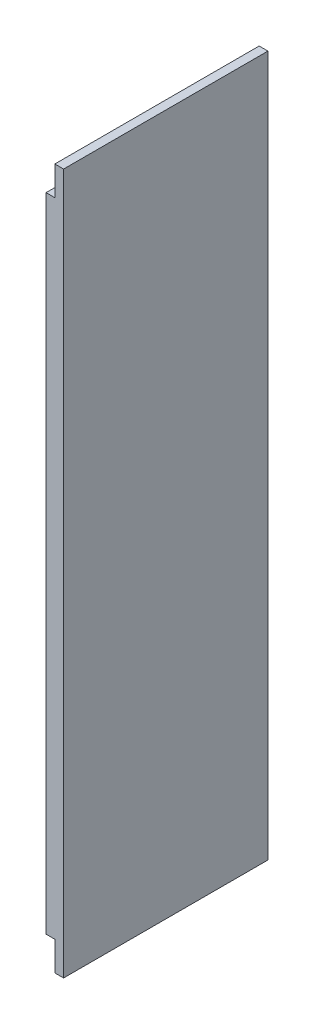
ISO-10303-21;
HEADER;
FILE_DESCRIPTION(('STEP AP214'),'2;1');
FILE_NAME('part.step','',(''),(''),'','','');
FILE_SCHEMA(('AUTOMOTIVE_DESIGN { 1 0 10303 214 1 1 1 1 }'));
ENDSEC;
DATA;
#1=APPLICATION_CONTEXT('core data for automotive mechanical design processes');
#2=APPLICATION_PROTOCOL_DEFINITION('international standard','automotive_design',2000,#1);
#3=PRODUCT_CONTEXT('',#1,'mechanical');
#4=PRODUCT('Part','Part','',(#3));
#5=PRODUCT_RELATED_PRODUCT_CATEGORY('part','',(#4));
#6=PRODUCT_DEFINITION_FORMATION('','',#4);
#7=PRODUCT_DEFINITION_CONTEXT('part definition',#1,'design');
#8=PRODUCT_DEFINITION('design','',#6,#7);
#9=PRODUCT_DEFINITION_SHAPE('','',#8);
#10=(LENGTH_UNIT() NAMED_UNIT(*) SI_UNIT(.MILLI.,.METRE.));
#11=(NAMED_UNIT(*) PLANE_ANGLE_UNIT() SI_UNIT($,.RADIAN.));
#12=(NAMED_UNIT(*) SI_UNIT($,.STERADIAN.) SOLID_ANGLE_UNIT());
#13=UNCERTAINTY_MEASURE_WITH_UNIT(LENGTH_MEASURE(1.E-05),#10,'distance_accuracy_value','');
#14=(GEOMETRIC_REPRESENTATION_CONTEXT(3) GLOBAL_UNCERTAINTY_ASSIGNED_CONTEXT((#13)) GLOBAL_UNIT_ASSIGNED_CONTEXT((#10,
#11,#12)) REPRESENTATION_CONTEXT('',''));
#15=CARTESIAN_POINT('',(0.,0.,0.));
#16=DIRECTION('',(0.,0.,1.));
#17=DIRECTION('',(1.,0.,0.));
#18=AXIS2_PLACEMENT_3D('',#15,#16,#17);
#19=CARTESIAN_POINT('',(-97.,0.,-310.018749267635));
#20=DIRECTION('',(-1.,0.,0.));
#21=DIRECTION('',(0.,0.,1.));
#22=AXIS2_PLACEMENT_3D('',#19,#20,#21);
#23=PLANE('',#22);
#24=DIRECTION('',(0.,1.,0.));
#25=VECTOR('',#24,1.);
#26=CARTESIAN_POINT('',(-97.,0.,-70.0000000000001));
#27=LINE('',#26,#25);
#28=CARTESIAN_POINT('',(-97.,-10.,-70.0000000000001));
#29=VERTEX_POINT('',#28);
#30=CARTESIAN_POINT('',(-97.,0.,-70.0000000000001));
#31=VERTEX_POINT('',#30);
#32=EDGE_CURVE('E58',#29,#31,#27,.T.);
#33=ORIENTED_EDGE('',*,*,#32,.F.);
#34=DIRECTION('',(0.,0.,1.));
#35=VECTOR('',#34,1.);
#36=CARTESIAN_POINT('',(-97.,-10.,-290.022325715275));
#37=LINE('',#36,#35);
#38=CARTESIAN_POINT('',(-97.,-10.,0.));
#39=VERTEX_POINT('',#38);
#40=EDGE_CURVE('E54',#29,#39,#37,.T.);
#41=ORIENTED_EDGE('',*,*,#40,.T.);
#42=DIRECTION('',(0.,-1.,0.));
#43=VECTOR('',#42,1.);
#44=CARTESIAN_POINT('',(-97.,0.,0.));
#45=LINE('',#44,#43);
#46=CARTESIAN_POINT('',(-97.,0.,0.));
#47=VERTEX_POINT('',#46);
#48=EDGE_CURVE('E155',#47,#39,#45,.T.);
#49=ORIENTED_EDGE('',*,*,#48,.F.);
#50=DIRECTION('',(0.,0.,1.));
#51=VECTOR('',#50,1.);
#52=CARTESIAN_POINT('',(-97.,0.,-310.018749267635));
#53=LINE('',#52,#51);
#54=EDGE_CURVE('E154',#31,#47,#53,.T.);
#55=ORIENTED_EDGE('',*,*,#54,.F.);
#56=EDGE_LOOP('',(#33,#41,#49,#55));
#57=FACE_BOUND('',#56,.T.);
#58=ADVANCED_FACE('F39',(#57),#23,.T.);
#59=DIRECTION('',(0.,0.,1.));
#60=VECTOR('',#59,1.);
#61=CARTESIAN_POINT('',(-97.,-230.001872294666,-290.022325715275));
#62=LINE('',#61,#60);
#63=CARTESIAN_POINT('',(-97.,-230.001872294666,-70.0000000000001));
#64=VERTEX_POINT('',#63);
#65=CARTESIAN_POINT('',(-97.,-230.001872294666,0.));
#66=VERTEX_POINT('',#65);
#67=EDGE_CURVE('E118',#64,#66,#62,.T.);
#68=ORIENTED_EDGE('',*,*,#67,.F.);
#69=CARTESIAN_POINT('',(-97.,-240.,-70.0000000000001));
#70=VERTEX_POINT('',#69);
#71=EDGE_CURVE('E141',#70,#64,#27,.T.);
#72=ORIENTED_EDGE('',*,*,#71,.F.);
#73=DIRECTION('',(0.,0.,1.));
#74=VECTOR('',#73,1.);
#75=CARTESIAN_POINT('',(-97.,-240.,-310.018749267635));
#76=LINE('',#75,#74);
#77=CARTESIAN_POINT('',(-97.,-240.,0.));
#78=VERTEX_POINT('',#77);
#79=EDGE_CURVE('E137',#70,#78,#76,.T.);
#80=ORIENTED_EDGE('',*,*,#79,.T.);
#81=EDGE_CURVE('E152',#66,#78,#45,.T.);
#82=ORIENTED_EDGE('',*,*,#81,.F.);
#83=EDGE_LOOP('',(#68,#72,#80,#82));
#84=FACE_BOUND('',#83,.T.);
#85=ADVANCED_FACE('F181',(#84),#23,.T.);
#86=CARTESIAN_POINT('',(-97.,0.,-310.018749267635));
#87=DIRECTION('',(0.,1.,0.));
#88=DIRECTION('',(0.,0.,1.));
#89=AXIS2_PLACEMENT_3D('',#86,#87,#88);
#90=PLANE('',#89);
#91=DIRECTION('',(1.,0.,0.));
#92=VECTOR('',#91,1.);
#93=CARTESIAN_POINT('',(-97.,0.,-70.0000000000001));
#94=LINE('',#93,#92);
#95=CARTESIAN_POINT('',(-93.9999999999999,0.,-70.0000000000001));
#96=VERTEX_POINT('',#95);
#97=EDGE_CURVE('E139',#31,#96,#94,.T.);
#98=ORIENTED_EDGE('',*,*,#97,.F.);
#99=ORIENTED_EDGE('',*,*,#54,.T.);
#100=DIRECTION('',(-1.,0.,0.));
#101=VECTOR('',#100,1.);
#102=CARTESIAN_POINT('',(-97.,0.,0.));
#103=LINE('',#102,#101);
#104=CARTESIAN_POINT('',(-93.9999999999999,0.,0.));
#105=VERTEX_POINT('',#104);
#106=EDGE_CURVE('E142',#105,#47,#103,.T.);
#107=ORIENTED_EDGE('',*,*,#106,.F.);
#108=DIRECTION('',(0.,0.,1.));
#109=VECTOR('',#108,1.);
#110=CARTESIAN_POINT('',(-93.9999999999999,0.,-310.018749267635));
#111=LINE('',#110,#109);
#112=EDGE_CURVE('E160',#96,#105,#111,.T.);
#113=ORIENTED_EDGE('',*,*,#112,.F.);
#114=EDGE_LOOP('',(#98,#99,#107,#113));
#115=FACE_BOUND('',#114,.T.);
#116=ADVANCED_FACE('F170',(#115),#90,.T.);
#117=CARTESIAN_POINT('',(-93.9999999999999,0.,-310.018749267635));
#118=DIRECTION('',(1.,0.,0.));
#119=DIRECTION('',(0.,0.,-1.));
#120=AXIS2_PLACEMENT_3D('',#117,#118,#119);
#121=PLANE('',#120);
#122=DIRECTION('',(0.,-1.,0.));
#123=VECTOR('',#122,1.);
#124=CARTESIAN_POINT('',(-93.9999999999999,0.,-70.0000000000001));
#125=LINE('',#124,#123);
#126=CARTESIAN_POINT('',(-93.9999999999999,-240.,-70.0000000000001));
#127=VERTEX_POINT('',#126);
#128=EDGE_CURVE('E43',#96,#127,#125,.T.);
#129=ORIENTED_EDGE('',*,*,#128,.F.);
#130=ORIENTED_EDGE('',*,*,#112,.T.);
#131=DIRECTION('',(0.,1.,0.));
#132=VECTOR('',#131,1.);
#133=CARTESIAN_POINT('',(-93.9999999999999,0.,0.));
#134=LINE('',#133,#132);
#135=CARTESIAN_POINT('',(-93.9999999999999,-240.,0.));
#136=VERTEX_POINT('',#135);
#137=EDGE_CURVE('E147',#136,#105,#134,.T.);
#138=ORIENTED_EDGE('',*,*,#137,.F.);
#139=DIRECTION('',(0.,0.,1.));
#140=VECTOR('',#139,1.);
#141=CARTESIAN_POINT('',(-93.9999999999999,-240.,-310.018749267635));
#142=LINE('',#141,#140);
#143=EDGE_CURVE('E159',#127,#136,#142,.T.);
#144=ORIENTED_EDGE('',*,*,#143,.F.);
#145=EDGE_LOOP('',(#129,#130,#138,#144));
#146=FACE_BOUND('',#145,.T.);
#147=ADVANCED_FACE('F172',(#146),#121,.T.);
#148=CARTESIAN_POINT('',(-97.,-240.,-310.018749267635));
#149=DIRECTION('',(0.,-1.,0.));
#150=DIRECTION('',(0.,0.,-1.));
#151=AXIS2_PLACEMENT_3D('',#148,#149,#150);
#152=PLANE('',#151);
#153=DIRECTION('',(-1.,0.,0.));
#154=VECTOR('',#153,1.);
#155=CARTESIAN_POINT('',(-97.,-240.,-70.0000000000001));
#156=LINE('',#155,#154);
#157=EDGE_CURVE('E11',#127,#70,#156,.T.);
#158=ORIENTED_EDGE('',*,*,#157,.F.);
#159=ORIENTED_EDGE('',*,*,#143,.T.);
#160=DIRECTION('',(1.,0.,0.));
#161=VECTOR('',#160,1.);
#162=CARTESIAN_POINT('',(-97.,-240.,0.));
#163=LINE('',#162,#161);
#164=EDGE_CURVE('E146',#78,#136,#163,.T.);
#165=ORIENTED_EDGE('',*,*,#164,.F.);
#166=ORIENTED_EDGE('',*,*,#79,.F.);
#167=EDGE_LOOP('',(#158,#159,#165,#166));
#168=FACE_BOUND('',#167,.T.);
#169=ADVANCED_FACE('F177',(#168),#152,.T.);
#170=CARTESIAN_POINT('',(0.,0.,0.));
#171=DIRECTION('',(0.,0.,1.));
#172=DIRECTION('',(1.,0.,0.));
#173=AXIS2_PLACEMENT_3D('',#170,#171,#172);
#174=PLANE('',#173);
#175=ORIENTED_EDGE('',*,*,#48,.T.);
#176=DIRECTION('',(-1.,0.,0.));
#177=VECTOR('',#176,1.);
#178=CARTESIAN_POINT('',(-100.,-10.,0.));
#179=LINE('',#178,#177);
#180=CARTESIAN_POINT('',(-100.,-10.,0.));
#181=VERTEX_POINT('',#180);
#182=EDGE_CURVE('E120',#39,#181,#179,.T.);
#183=ORIENTED_EDGE('',*,*,#182,.T.);
#184=DIRECTION('',(0.,-1.,0.));
#185=VECTOR('',#184,1.);
#186=CARTESIAN_POINT('',(-100.,-10.,0.));
#187=LINE('',#186,#185);
#188=CARTESIAN_POINT('',(-100.,-230.001872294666,0.));
#189=VERTEX_POINT('',#188);
#190=EDGE_CURVE('E112',#181,#189,#187,.T.);
#191=ORIENTED_EDGE('',*,*,#190,.T.);
#192=DIRECTION('',(1.,0.,0.));
#193=VECTOR('',#192,1.);
#194=CARTESIAN_POINT('',(-100.,-230.001872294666,0.));
#195=LINE('',#194,#193);
#196=EDGE_CURVE('E123',#189,#66,#195,.T.);
#197=ORIENTED_EDGE('',*,*,#196,.T.);
#198=ORIENTED_EDGE('',*,*,#81,.T.);
#199=ORIENTED_EDGE('',*,*,#164,.T.);
#200=ORIENTED_EDGE('',*,*,#137,.T.);
#201=ORIENTED_EDGE('',*,*,#106,.T.);
#202=EDGE_LOOP('',(#175,#183,#191,#197,#198,#199,#200,#201));
#203=FACE_BOUND('',#202,.T.);
#204=ADVANCED_FACE('F124',(#203),#174,.T.);
#205=CARTESIAN_POINT('',(-97.,-40.,-70.0000000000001));
#206=DIRECTION('',(0.,0.,1.));
#207=DIRECTION('',(0.,-1.,0.));
#208=AXIS2_PLACEMENT_3D('',#205,#206,#207);
#209=PLANE('',#208);
#210=ORIENTED_EDGE('',*,*,#71,.T.);
#211=DIRECTION('',(-1.,0.,0.));
#212=VECTOR('',#211,1.);
#213=CARTESIAN_POINT('',(-100.,-230.001872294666,-70.0000000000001));
#214=LINE('',#213,#212);
#215=CARTESIAN_POINT('',(-100.,-230.001872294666,-70.0000000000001));
#216=VERTEX_POINT('',#215);
#217=EDGE_CURVE('E140',#64,#216,#214,.T.);
#218=ORIENTED_EDGE('',*,*,#217,.T.);
#219=DIRECTION('',(0.,1.,0.));
#220=VECTOR('',#219,1.);
#221=CARTESIAN_POINT('',(-100.,-10.,-70.0000000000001));
#222=LINE('',#221,#220);
#223=CARTESIAN_POINT('',(-100.,-10.,-70.0000000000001));
#224=VERTEX_POINT('',#223);
#225=EDGE_CURVE('E111',#216,#224,#222,.T.);
#226=ORIENTED_EDGE('',*,*,#225,.T.);
#227=DIRECTION('',(1.,0.,0.));
#228=VECTOR('',#227,1.);
#229=CARTESIAN_POINT('',(-100.,-10.,-70.0000000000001));
#230=LINE('',#229,#228);
#231=EDGE_CURVE('E132',#224,#29,#230,.T.);
#232=ORIENTED_EDGE('',*,*,#231,.T.);
#233=ORIENTED_EDGE('',*,*,#32,.T.);
#234=ORIENTED_EDGE('',*,*,#97,.T.);
#235=ORIENTED_EDGE('',*,*,#128,.T.);
#236=ORIENTED_EDGE('',*,*,#157,.T.);
#237=EDGE_LOOP('',(#210,#218,#226,#232,#233,#234,#235,#236));
#238=FACE_BOUND('',#237,.T.);
#239=ADVANCED_FACE('F41',(#238),#209,.F.);
#240=CARTESIAN_POINT('',(-100.,-10.,-290.022325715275));
#241=DIRECTION('',(-1.,0.,0.));
#242=DIRECTION('',(0.,0.,1.));
#243=AXIS2_PLACEMENT_3D('',#240,#241,#242);
#244=PLANE('',#243);
#245=ORIENTED_EDGE('',*,*,#225,.F.);
#246=DIRECTION('',(0.,0.,1.));
#247=VECTOR('',#246,1.);
#248=CARTESIAN_POINT('',(-100.,-230.001872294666,-290.022325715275));
#249=LINE('',#248,#247);
#250=EDGE_CURVE('E108',#216,#189,#249,.T.);
#251=ORIENTED_EDGE('',*,*,#250,.T.);
#252=ORIENTED_EDGE('',*,*,#190,.F.);
#253=DIRECTION('',(0.,0.,1.));
#254=VECTOR('',#253,1.);
#255=CARTESIAN_POINT('',(-100.,-10.,-290.022325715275));
#256=LINE('',#255,#254);
#257=EDGE_CURVE('E135',#224,#181,#256,.T.);
#258=ORIENTED_EDGE('',*,*,#257,.F.);
#259=EDGE_LOOP('',(#245,#251,#252,#258));
#260=FACE_BOUND('',#259,.T.);
#261=ADVANCED_FACE('F106',(#260),#244,.T.);
#262=CARTESIAN_POINT('',(-100.,-10.,-290.022325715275));
#263=DIRECTION('',(0.,1.,0.));
#264=DIRECTION('',(0.,0.,1.));
#265=AXIS2_PLACEMENT_3D('',#262,#263,#264);
#266=PLANE('',#265);
#267=ORIENTED_EDGE('',*,*,#231,.F.);
#268=ORIENTED_EDGE('',*,*,#257,.T.);
#269=ORIENTED_EDGE('',*,*,#182,.F.);
#270=ORIENTED_EDGE('',*,*,#40,.F.);
#271=EDGE_LOOP('',(#267,#268,#269,#270));
#272=FACE_BOUND('',#271,.T.);
#273=ADVANCED_FACE('F200',(#272),#266,.T.);
#274=CARTESIAN_POINT('',(-100.,-230.001872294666,-290.022325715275));
#275=DIRECTION('',(0.,-1.,0.));
#276=DIRECTION('',(0.,0.,-1.));
#277=AXIS2_PLACEMENT_3D('',#274,#275,#276);
#278=PLANE('',#277);
#279=ORIENTED_EDGE('',*,*,#217,.F.);
#280=ORIENTED_EDGE('',*,*,#67,.T.);
#281=ORIENTED_EDGE('',*,*,#196,.F.);
#282=ORIENTED_EDGE('',*,*,#250,.F.);
#283=EDGE_LOOP('',(#279,#280,#281,#282));
#284=FACE_BOUND('',#283,.T.);
#285=ADVANCED_FACE('F122',(#284),#278,.T.);
#286=CLOSED_SHELL('',(#58,#85,#116,#147,#169,#204,#239,#261,#273,#285));
#287=MANIFOLD_SOLID_BREP('B2',#286);
#288=ADVANCED_BREP_SHAPE_REPRESENTATION('',(#18,#287),#14);
#289=SHAPE_DEFINITION_REPRESENTATION(#9,#288);
ENDSEC;
END-ISO-10303-21;
